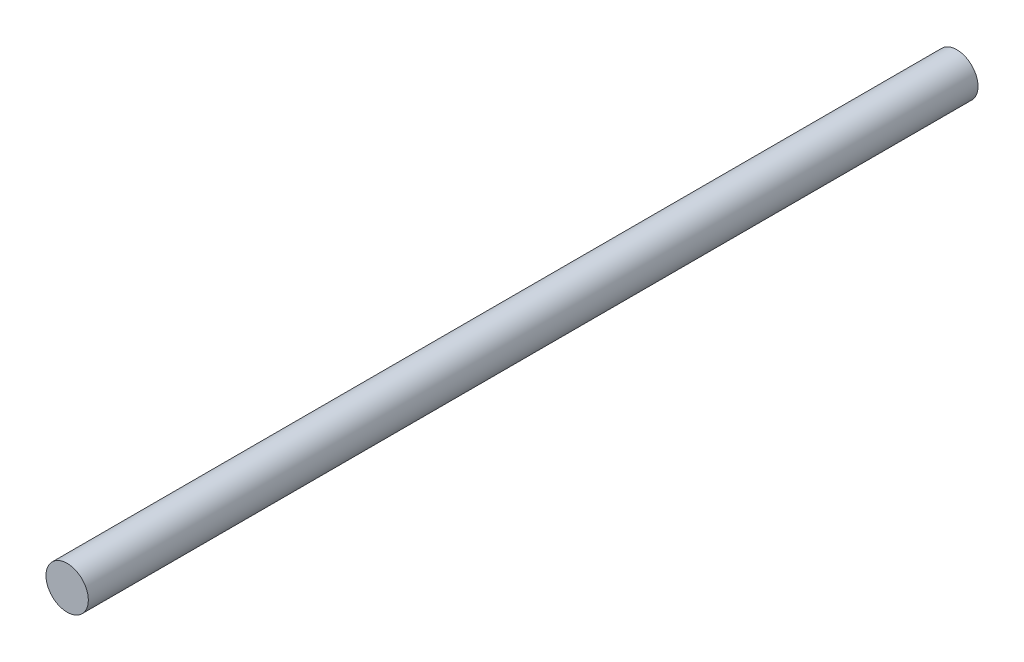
from build123d import *

# Parameters (mm, degrees)
SKETCH1_R           = 6.35
BOSS_EXTRUDE1_DEPTH = 266.7


with BuildPart() as part:
    # Sketch1 → Boss-Extrude1 (new body)
    with BuildSketch(Plane.XY):
        Circle(SKETCH1_R)
    extrude(amount=BOSS_EXTRUDE1_DEPTH)


solid = part.part
